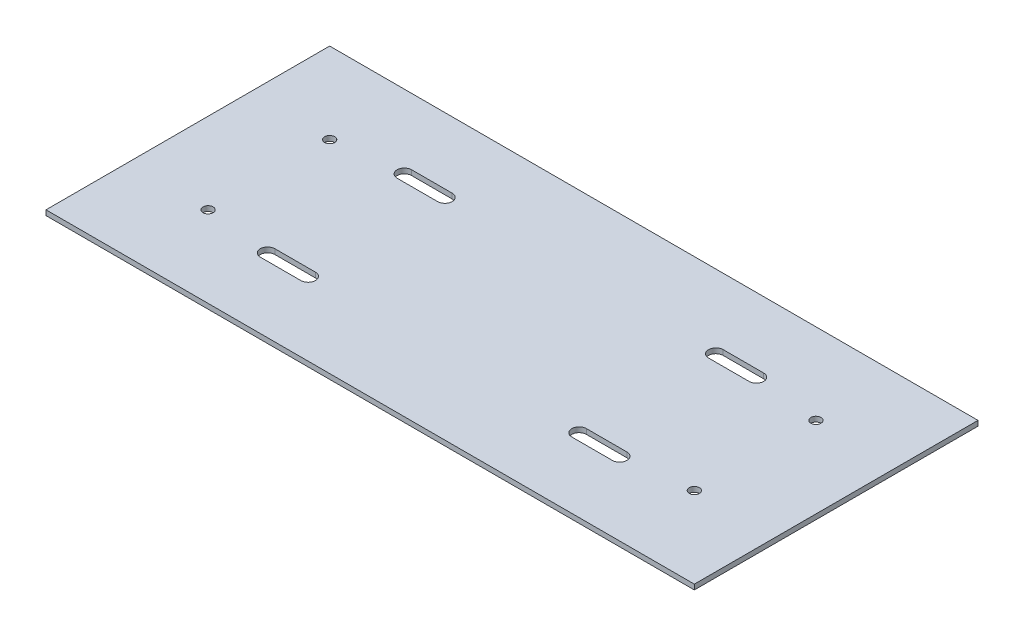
from build123d import *

# Parameters (mm, degrees)
SKETCH2_W           = 406.4
SKETCH2_H           = 3.175
BOSS_EXTRUDE1_DEPTH = 177.8
CUT_EXTRUDE2_REACH  = 272.024
SKETCH4_W           = 406.4
SKETCH4_H           = 88.9
SKETCH5_R           = 3.175
CUT_EXTRUDE3_DEPTH  = 222.818688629
CUT_EXTRUDE4_DEPTH  = 222.818688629


with BuildPart() as part:
    # Sketch2 → Boss-Extrude1 (new, symmetric)
    with BuildSketch(Plane.XY):
        with Locations((0, 1.5875)):
            Rectangle(SKETCH2_W, SKETCH2_H)
    extrude(amount=BOSS_EXTRUDE1_DEPTH, both=True)

    # Sketch4 → Cut-Extrude2 (cut, up to next)
    with BuildSketch(Plane(origin=(0, 3.175, 0), x_dir=(1, 0, 0), z_dir=(0, 1, 0)), mode=Mode.PRIVATE) as cut_extrude2_sk1:
        with Locations((0, 133.35)):
            Rectangle(SKETCH4_W, SKETCH4_H)
    cut_extrude2_tool1 = extrude(cut_extrude2_sk1.sketch, amount=-CUT_EXTRUDE2_REACH, mode=Mode.PRIVATE) & part.part
    # Sketch4 → Cut-Extrude2 (cut, up to next)
    with BuildSketch(Plane(origin=(0, 3.175, 0), x_dir=(1, 0, 0), z_dir=(0, 1, 0)), mode=Mode.PRIVATE) as cut_extrude2_sk2:
        with Locations((0, -133.35)):
            Rectangle(SKETCH4_W, SKETCH4_H)
    cut_extrude2_tool2 = extrude(cut_extrude2_sk2.sketch, amount=-CUT_EXTRUDE2_REACH, mode=Mode.PRIVATE) & part.part
    add(cut_extrude2_tool1.solids().sort_by_distance((0, 3.175, -133.35))[0], mode=Mode.SUBTRACT)
    add(cut_extrude2_tool2.solids().sort_by_distance((0, 3.175, 133.35))[0], mode=Mode.SUBTRACT)

    # Sketch5 → Cut-Extrude3 (cut, through all)
    with BuildSketch(Plane(origin=(0, 3.175, 0), x_dir=(1, 0, 0), z_dir=(0, 1, 0))):
        with Locations(Location((-152.4, 38.1, 0), (0, 0, 180))):
            Circle(SKETCH5_R)
        with Locations(Location((-152.4, -38.1, 0), (0, 0, 180))):
            Circle(SKETCH5_R)
        with Locations((152.4, -38.1)):
            Circle(SKETCH5_R)
        with Locations((152.4, 38.1)):
            Circle(SKETCH5_R)
    extrude(amount=-CUT_EXTRUDE3_DEPTH, mode=Mode.SUBTRACT)

    # Sketch6 → Cut-Extrude4 (cut, through all)
    with BuildSketch(Plane(origin=(0, 3.175, 0), x_dir=(1, 0, 0), z_dir=(0, 1, 0))):
        with BuildLine():
            Line((-110.337600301, 47.4345), (-84.937599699, 47.4345))
            ThreePointArc((-84.937599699, 47.4345), (-80.365600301, 42.862499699), (-84.937600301, 38.2905))
            Line((-84.937600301, 38.2905), (-110.337600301, 38.2905))
            ThreePointArc((-110.337600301, 38.2905), (-114.909600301, 42.8625), (-110.337600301, 47.4345))
        make_face()
        with BuildLine():
            Line((110.337600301, 38.2905), (84.937600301, 38.2905))
            ThreePointArc((84.937600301, 38.2905), (80.365600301, 42.862499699), (84.937599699, 47.4345))
            Line((84.937599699, 47.4345), (110.337600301, 47.4345))
            ThreePointArc((110.337600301, 47.4345), (114.909600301, 42.8625), (110.337600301, 38.2905))
        make_face()
        with BuildLine():
            Line((110.337600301, -47.4345), (84.937599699, -47.4345))
            ThreePointArc((84.937599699, -47.4345), (80.365600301, -42.862499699), (84.937600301, -38.2905))
            Line((84.937600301, -38.2905), (110.337600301, -38.2905))
            ThreePointArc((110.337600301, -38.2905), (114.909600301, -42.8625), (110.337600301, -47.4345))
        make_face()
        with BuildLine():
            Line((-110.337600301, -38.2905), (-84.937600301, -38.2905))
            ThreePointArc((-84.937600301, -38.2905), (-80.365600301, -42.862499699), (-84.937599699, -47.4345))
            Line((-84.937599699, -47.4345), (-110.337600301, -47.4345))
            ThreePointArc((-110.337600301, -47.4345), (-114.909600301, -42.8625), (-110.337600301, -38.2905))
        make_face()
    extrude(amount=-CUT_EXTRUDE4_DEPTH, mode=Mode.SUBTRACT)


solid = part.part
